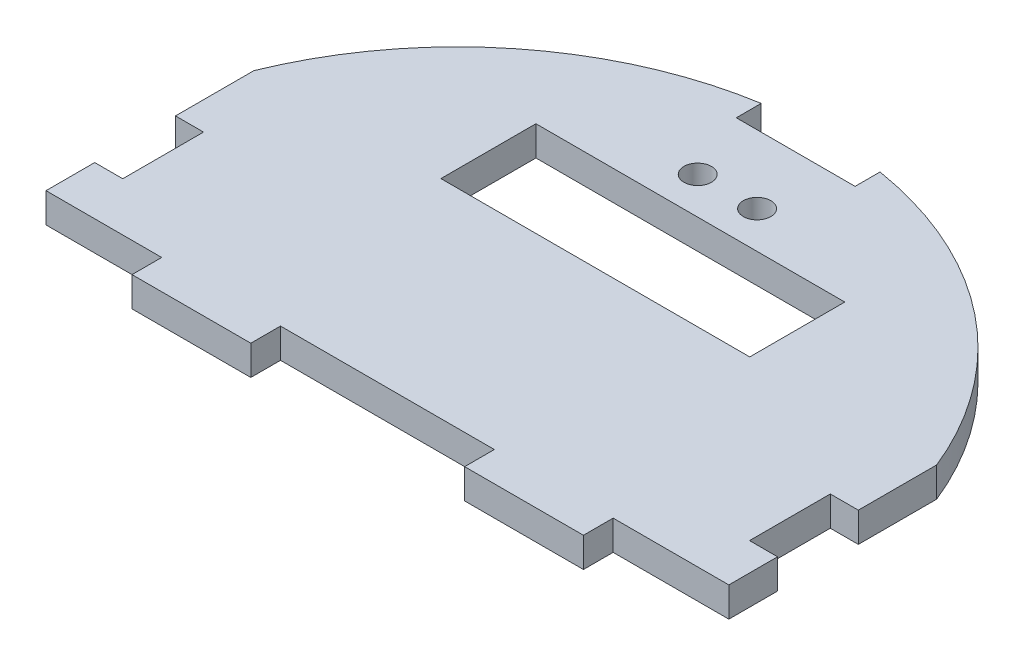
ISO-10303-21;
HEADER;
FILE_DESCRIPTION(('STEP AP214'),'2;1');
FILE_NAME('part.step','',(''),(''),'','','');
FILE_SCHEMA(('AUTOMOTIVE_DESIGN { 1 0 10303 214 1 1 1 1 }'));
ENDSEC;
DATA;
#1=APPLICATION_CONTEXT('core data for automotive mechanical design processes');
#2=APPLICATION_PROTOCOL_DEFINITION('international standard','automotive_design',2000,#1);
#3=PRODUCT_CONTEXT('',#1,'mechanical');
#4=PRODUCT('Part','Part','',(#3));
#5=PRODUCT_RELATED_PRODUCT_CATEGORY('part','',(#4));
#6=PRODUCT_DEFINITION_FORMATION('','',#4);
#7=PRODUCT_DEFINITION_CONTEXT('part definition',#1,'design');
#8=PRODUCT_DEFINITION('design','',#6,#7);
#9=PRODUCT_DEFINITION_SHAPE('','',#8);
#10=(LENGTH_UNIT() NAMED_UNIT(*) SI_UNIT(.MILLI.,.METRE.));
#11=(NAMED_UNIT(*) PLANE_ANGLE_UNIT() SI_UNIT($,.RADIAN.));
#12=(NAMED_UNIT(*) SI_UNIT($,.STERADIAN.) SOLID_ANGLE_UNIT());
#13=UNCERTAINTY_MEASURE_WITH_UNIT(LENGTH_MEASURE(1.E-05),#10,'distance_accuracy_value','');
#14=(GEOMETRIC_REPRESENTATION_CONTEXT(3) GLOBAL_UNCERTAINTY_ASSIGNED_CONTEXT((#13)) GLOBAL_UNIT_ASSIGNED_CONTEXT((#10,
#11,#12)) REPRESENTATION_CONTEXT('',''));
#15=CARTESIAN_POINT('',(0.,0.,0.));
#16=DIRECTION('',(0.,0.,1.));
#17=DIRECTION('',(1.,0.,0.));
#18=AXIS2_PLACEMENT_3D('',#15,#16,#17);
#19=CARTESIAN_POINT('',(-75.3970171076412,3.175,-20.56));
#20=DIRECTION('',(0.,0.,-1.));
#21=DIRECTION('',(-1.,0.,0.));
#22=AXIS2_PLACEMENT_3D('',#19,#20,#21);
#23=PLANE('',#22);
#24=DIRECTION('',(1.,0.,0.));
#25=VECTOR('',#24,1.);
#26=CARTESIAN_POINT('',(-75.3970171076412,0.,-20.56));
#27=LINE('',#26,#25);
#28=CARTESIAN_POINT('',(-16.51,0.,-20.56));
#29=VERTEX_POINT('',#28);
#30=CARTESIAN_POINT('',(16.51,0.,-20.56));
#31=VERTEX_POINT('',#30);
#32=EDGE_CURVE('E323',#29,#31,#27,.T.);
#33=ORIENTED_EDGE('',*,*,#32,.T.);
#34=DIRECTION('',(0.,-1.,0.));
#35=VECTOR('',#34,1.);
#36=CARTESIAN_POINT('',(16.51,3.175,-20.56));
#37=LINE('',#36,#35);
#38=CARTESIAN_POINT('',(16.51,3.175,-20.56));
#39=VERTEX_POINT('',#38);
#40=EDGE_CURVE('E11',#39,#31,#37,.T.);
#41=ORIENTED_EDGE('',*,*,#40,.F.);
#42=DIRECTION('',(1.,0.,0.));
#43=VECTOR('',#42,1.);
#44=CARTESIAN_POINT('',(-75.3970171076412,3.175,-20.56));
#45=LINE('',#44,#43);
#46=CARTESIAN_POINT('',(-16.51,3.175,-20.56));
#47=VERTEX_POINT('',#46);
#48=EDGE_CURVE('E233',#47,#39,#45,.T.);
#49=ORIENTED_EDGE('',*,*,#48,.F.);
#50=DIRECTION('',(0.,-1.,0.));
#51=VECTOR('',#50,1.);
#52=CARTESIAN_POINT('',(-16.51,3.175,-20.56));
#53=LINE('',#52,#51);
#54=EDGE_CURVE('E52',#47,#29,#53,.T.);
#55=ORIENTED_EDGE('',*,*,#54,.T.);
#56=EDGE_LOOP('',(#33,#41,#49,#55));
#57=FACE_BOUND('',#56,.T.);
#58=ADVANCED_FACE('F33',(#57),#23,.F.);
#59=CARTESIAN_POINT('',(16.51,3.175,-9.97536585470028));
#60=DIRECTION('',(1.,0.,0.));
#61=DIRECTION('',(0.,0.,-1.));
#62=AXIS2_PLACEMENT_3D('',#59,#60,#61);
#63=PLANE('',#62);
#64=DIRECTION('',(0.,0.,1.));
#65=VECTOR('',#64,1.);
#66=CARTESIAN_POINT('',(16.51,0.,-9.97536585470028));
#67=LINE('',#66,#65);
#68=CARTESIAN_POINT('',(16.51,0.,-10.4));
#69=VERTEX_POINT('',#68);
#70=EDGE_CURVE('E239',#31,#69,#67,.T.);
#71=ORIENTED_EDGE('',*,*,#70,.T.);
#72=DIRECTION('',(0.,-1.,0.));
#73=VECTOR('',#72,1.);
#74=CARTESIAN_POINT('',(16.51,3.175,-10.4));
#75=LINE('',#74,#73);
#76=CARTESIAN_POINT('',(16.51,3.175,-10.4));
#77=VERTEX_POINT('',#76);
#78=EDGE_CURVE('E43',#77,#69,#75,.T.);
#79=ORIENTED_EDGE('',*,*,#78,.F.);
#80=DIRECTION('',(0.,0.,1.));
#81=VECTOR('',#80,1.);
#82=CARTESIAN_POINT('',(16.51,3.175,-9.97536585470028));
#83=LINE('',#82,#81);
#84=EDGE_CURVE('E226',#39,#77,#83,.T.);
#85=ORIENTED_EDGE('',*,*,#84,.F.);
#86=ORIENTED_EDGE('',*,*,#40,.T.);
#87=EDGE_LOOP('',(#71,#79,#85,#86));
#88=FACE_BOUND('',#87,.T.);
#89=ADVANCED_FACE('F238',(#88),#63,.F.);
#90=CARTESIAN_POINT('',(-75.3970171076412,3.175,-10.4));
#91=DIRECTION('',(0.,0.,-1.));
#92=DIRECTION('',(-1.,0.,0.));
#93=AXIS2_PLACEMENT_3D('',#90,#91,#92);
#94=PLANE('',#93);
#95=DIRECTION('',(1.,0.,0.));
#96=VECTOR('',#95,1.);
#97=CARTESIAN_POINT('',(-75.3970171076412,0.,-10.4));
#98=LINE('',#97,#96);
#99=CARTESIAN_POINT('',(-16.51,0.,-10.4));
#100=VERTEX_POINT('',#99);
#101=EDGE_CURVE('E326',#100,#69,#98,.T.);
#102=ORIENTED_EDGE('',*,*,#101,.F.);
#103=DIRECTION('',(0.,-1.,0.));
#104=VECTOR('',#103,1.);
#105=CARTESIAN_POINT('',(-16.51,3.175,-10.4));
#106=LINE('',#105,#104);
#107=CARTESIAN_POINT('',(-16.51,3.175,-10.4));
#108=VERTEX_POINT('',#107);
#109=EDGE_CURVE('E138',#108,#100,#106,.T.);
#110=ORIENTED_EDGE('',*,*,#109,.F.);
#111=DIRECTION('',(1.,0.,0.));
#112=VECTOR('',#111,1.);
#113=CARTESIAN_POINT('',(-75.3970171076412,3.175,-10.4));
#114=LINE('',#113,#112);
#115=EDGE_CURVE('E232',#108,#77,#114,.T.);
#116=ORIENTED_EDGE('',*,*,#115,.T.);
#117=ORIENTED_EDGE('',*,*,#78,.T.);
#118=EDGE_LOOP('',(#102,#110,#116,#117));
#119=FACE_BOUND('',#118,.T.);
#120=ADVANCED_FACE('F243',(#119),#94,.T.);
#121=CARTESIAN_POINT('',(0.,3.175,4.37825203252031));
#122=DIRECTION('',(0.,-1.,0.));
#123=DIRECTION('',(0.,0.,-1.));
#124=AXIS2_PLACEMENT_3D('',#121,#122,#123);
#125=CYLINDRICAL_SURFACE('',#124,39.3782520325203);
#126=CARTESIAN_POINT('',(0.,0.,4.37825203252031));
#127=DIRECTION('',(0.,1.,0.));
#128=DIRECTION('',(0.,0.,1.));
#129=AXIS2_PLACEMENT_3D('',#126,#127,#128);
#130=CIRCLE('',#129,39.3782520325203);
#131=CARTESIAN_POINT('',(-36.5,0.,-10.4));
#132=VERTEX_POINT('',#131);
#133=CARTESIAN_POINT('',(-6.35000000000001,0.,-34.4846381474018));
#134=VERTEX_POINT('',#133);
#135=EDGE_CURVE('E256',#132,#134,#130,.F.);
#136=ORIENTED_EDGE('',*,*,#135,.F.);
#137=DIRECTION('',(0.,-1.,0.));
#138=VECTOR('',#137,1.);
#139=CARTESIAN_POINT('',(-36.5,3.175,-10.4));
#140=LINE('',#139,#138);
#141=CARTESIAN_POINT('',(-36.5,3.175,-10.4));
#142=VERTEX_POINT('',#141);
#143=EDGE_CURVE('E37',#142,#132,#140,.T.);
#144=ORIENTED_EDGE('',*,*,#143,.F.);
#145=CARTESIAN_POINT('',(0.,3.175,4.37825203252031));
#146=DIRECTION('',(0.,1.,0.));
#147=DIRECTION('',(0.,0.,1.));
#148=AXIS2_PLACEMENT_3D('',#145,#146,#147);
#149=CIRCLE('',#148,39.3782520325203);
#150=CARTESIAN_POINT('',(-6.35000000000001,3.175,-34.4846381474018));
#151=VERTEX_POINT('',#150);
#152=EDGE_CURVE('E337',#142,#151,#149,.F.);
#153=ORIENTED_EDGE('',*,*,#152,.T.);
#154=DIRECTION('',(0.,-1.,0.));
#155=VECTOR('',#154,1.);
#156=CARTESIAN_POINT('',(-6.35000000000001,3.175,-34.4846381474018));
#157=LINE('',#156,#155);
#158=EDGE_CURVE('E255',#151,#134,#157,.T.);
#159=ORIENTED_EDGE('',*,*,#158,.T.);
#160=EDGE_LOOP('',(#136,#144,#153,#159));
#161=FACE_BOUND('',#160,.T.);
#162=ADVANCED_FACE('F35',(#161),#125,.T.);
#163=CARTESIAN_POINT('',(-36.5,3.175,-9.97536585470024));
#164=DIRECTION('',(-1.,0.,0.));
#165=DIRECTION('',(0.,0.,1.));
#166=AXIS2_PLACEMENT_3D('',#163,#164,#165);
#167=PLANE('',#166);
#168=DIRECTION('',(0.,0.,-1.));
#169=VECTOR('',#168,1.);
#170=CARTESIAN_POINT('',(-36.5,0.,-9.97536585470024));
#171=LINE('',#170,#169);
#172=CARTESIAN_POINT('',(-36.5,0.,-2.018));
#173=VERTEX_POINT('',#172);
#174=EDGE_CURVE('E259',#173,#132,#171,.T.);
#175=ORIENTED_EDGE('',*,*,#174,.F.);
#176=DIRECTION('',(0.,-1.,0.));
#177=VECTOR('',#176,1.);
#178=CARTESIAN_POINT('',(-36.5,3.175,-2.018));
#179=LINE('',#178,#177);
#180=CARTESIAN_POINT('',(-36.5,3.175,-2.018));
#181=VERTEX_POINT('',#180);
#182=EDGE_CURVE('E387',#181,#173,#179,.T.);
#183=ORIENTED_EDGE('',*,*,#182,.F.);
#184=DIRECTION('',(0.,0.,-1.));
#185=VECTOR('',#184,1.);
#186=CARTESIAN_POINT('',(-36.5,3.175,-9.97536585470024));
#187=LINE('',#186,#185);
#188=EDGE_CURVE('E396',#181,#142,#187,.T.);
#189=ORIENTED_EDGE('',*,*,#188,.T.);
#190=ORIENTED_EDGE('',*,*,#143,.T.);
#191=EDGE_LOOP('',(#175,#183,#189,#190));
#192=FACE_BOUND('',#191,.T.);
#193=ADVANCED_FACE('F394',(#192),#167,.T.);
#194=CARTESIAN_POINT('',(-75.3970171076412,3.175,-2.01800000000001));
#195=DIRECTION('',(0.,0.,-1.));
#196=DIRECTION('',(-1.,0.,0.));
#197=AXIS2_PLACEMENT_3D('',#194,#195,#196);
#198=PLANE('',#197);
#199=DIRECTION('',(1.,0.,0.));
#200=VECTOR('',#199,1.);
#201=CARTESIAN_POINT('',(-75.3970171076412,0.,-2.01800000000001));
#202=LINE('',#201,#200);
#203=CARTESIAN_POINT('',(-33.5028,0.,-2.018));
#204=VERTEX_POINT('',#203);
#205=EDGE_CURVE('E262',#173,#204,#202,.T.);
#206=ORIENTED_EDGE('',*,*,#205,.T.);
#207=DIRECTION('',(0.,-1.,0.));
#208=VECTOR('',#207,1.);
#209=CARTESIAN_POINT('',(-33.5028,3.175,-2.018));
#210=LINE('',#209,#208);
#211=CARTESIAN_POINT('',(-33.5028,3.175,-2.018));
#212=VERTEX_POINT('',#211);
#213=EDGE_CURVE('E386',#212,#204,#210,.T.);
#214=ORIENTED_EDGE('',*,*,#213,.F.);
#215=DIRECTION('',(1.,0.,0.));
#216=VECTOR('',#215,1.);
#217=CARTESIAN_POINT('',(-75.3970171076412,3.175,-2.01800000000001));
#218=LINE('',#217,#216);
#219=EDGE_CURVE('E405',#181,#212,#218,.T.);
#220=ORIENTED_EDGE('',*,*,#219,.F.);
#221=ORIENTED_EDGE('',*,*,#182,.T.);
#222=EDGE_LOOP('',(#206,#214,#220,#221));
#223=FACE_BOUND('',#222,.T.);
#224=ADVANCED_FACE('F403',(#223),#198,.F.);
#225=CARTESIAN_POINT('',(-33.5028,3.175,-9.97536585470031));
#226=DIRECTION('',(-1.,0.,0.));
#227=DIRECTION('',(0.,0.,1.));
#228=AXIS2_PLACEMENT_3D('',#225,#226,#227);
#229=PLANE('',#228);
#230=DIRECTION('',(0.,0.,-1.));
#231=VECTOR('',#230,1.);
#232=CARTESIAN_POINT('',(-33.5028,0.,-9.97536585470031));
#233=LINE('',#232,#231);
#234=CARTESIAN_POINT('',(-33.5028,0.,6.61799999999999));
#235=VERTEX_POINT('',#234);
#236=EDGE_CURVE('E265',#235,#204,#233,.T.);
#237=ORIENTED_EDGE('',*,*,#236,.F.);
#238=DIRECTION('',(0.,-1.,0.));
#239=VECTOR('',#238,1.);
#240=CARTESIAN_POINT('',(-33.5028,3.175,6.61799999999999));
#241=LINE('',#240,#239);
#242=CARTESIAN_POINT('',(-33.5028,3.175,6.61799999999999));
#243=VERTEX_POINT('',#242);
#244=EDGE_CURVE('E384',#243,#235,#241,.T.);
#245=ORIENTED_EDGE('',*,*,#244,.F.);
#246=DIRECTION('',(0.,0.,-1.));
#247=VECTOR('',#246,1.);
#248=CARTESIAN_POINT('',(-33.5028,3.175,-9.97536585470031));
#249=LINE('',#248,#247);
#250=EDGE_CURVE('E408',#243,#212,#249,.T.);
#251=ORIENTED_EDGE('',*,*,#250,.T.);
#252=ORIENTED_EDGE('',*,*,#213,.T.);
#253=EDGE_LOOP('',(#237,#245,#251,#252));
#254=FACE_BOUND('',#253,.T.);
#255=ADVANCED_FACE('F409',(#254),#229,.T.);
#256=CARTESIAN_POINT('',(-75.3970171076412,3.175,6.61799999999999));
#257=DIRECTION('',(0.,0.,-1.));
#258=DIRECTION('',(-1.,0.,0.));
#259=AXIS2_PLACEMENT_3D('',#256,#257,#258);
#260=PLANE('',#259);
#261=DIRECTION('',(1.,0.,0.));
#262=VECTOR('',#261,1.);
#263=CARTESIAN_POINT('',(-75.3970171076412,0.,6.61799999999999));
#264=LINE('',#263,#262);
#265=CARTESIAN_POINT('',(-36.5,0.,6.618));
#266=VERTEX_POINT('',#265);
#267=EDGE_CURVE('E268',#266,#235,#264,.T.);
#268=ORIENTED_EDGE('',*,*,#267,.F.);
#269=DIRECTION('',(0.,-1.,0.));
#270=VECTOR('',#269,1.);
#271=CARTESIAN_POINT('',(-36.5,3.175,6.618));
#272=LINE('',#271,#270);
#273=CARTESIAN_POINT('',(-36.5,3.175,6.618));
#274=VERTEX_POINT('',#273);
#275=EDGE_CURVE('E382',#274,#266,#272,.T.);
#276=ORIENTED_EDGE('',*,*,#275,.F.);
#277=DIRECTION('',(1.,0.,0.));
#278=VECTOR('',#277,1.);
#279=CARTESIAN_POINT('',(-75.3970171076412,3.175,6.61799999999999));
#280=LINE('',#279,#278);
#281=EDGE_CURVE('E413',#274,#243,#280,.T.);
#282=ORIENTED_EDGE('',*,*,#281,.T.);
#283=ORIENTED_EDGE('',*,*,#244,.T.);
#284=EDGE_LOOP('',(#268,#276,#282,#283));
#285=FACE_BOUND('',#284,.T.);
#286=ADVANCED_FACE('F548',(#285),#260,.T.);
#287=CARTESIAN_POINT('',(-36.5,3.175,-9.97536585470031));
#288=DIRECTION('',(1.,0.,0.));
#289=DIRECTION('',(0.,0.,-1.));
#290=AXIS2_PLACEMENT_3D('',#287,#288,#289);
#291=PLANE('',#290);
#292=DIRECTION('',(0.,0.,1.));
#293=VECTOR('',#292,1.);
#294=CARTESIAN_POINT('',(-36.5,0.,-9.97536585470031));
#295=LINE('',#294,#293);
#296=CARTESIAN_POINT('',(-36.5,0.,11.825));
#297=VERTEX_POINT('',#296);
#298=EDGE_CURVE('E271',#266,#297,#295,.T.);
#299=ORIENTED_EDGE('',*,*,#298,.T.);
#300=DIRECTION('',(0.,-1.,0.));
#301=VECTOR('',#300,1.);
#302=CARTESIAN_POINT('',(-36.5,3.175,11.825));
#303=LINE('',#302,#301);
#304=CARTESIAN_POINT('',(-36.5,3.175,11.825));
#305=VERTEX_POINT('',#304);
#306=EDGE_CURVE('E380',#305,#297,#303,.T.);
#307=ORIENTED_EDGE('',*,*,#306,.F.);
#308=DIRECTION('',(0.,0.,1.));
#309=VECTOR('',#308,1.);
#310=CARTESIAN_POINT('',(-36.5,3.175,-9.97536585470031));
#311=LINE('',#310,#309);
#312=EDGE_CURVE('E415',#274,#305,#311,.T.);
#313=ORIENTED_EDGE('',*,*,#312,.F.);
#314=ORIENTED_EDGE('',*,*,#275,.T.);
#315=EDGE_LOOP('',(#299,#307,#313,#314));
#316=FACE_BOUND('',#315,.T.);
#317=ADVANCED_FACE('F550',(#316),#291,.F.);
#318=CARTESIAN_POINT('',(-75.3970171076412,3.175,11.825));
#319=DIRECTION('',(0.,0.,1.));
#320=DIRECTION('',(1.,0.,0.));
#321=AXIS2_PLACEMENT_3D('',#318,#319,#320);
#322=PLANE('',#321);
#323=DIRECTION('',(-1.,0.,0.));
#324=VECTOR('',#323,1.);
#325=CARTESIAN_POINT('',(-75.3970171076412,0.,11.825));
#326=LINE('',#325,#324);
#327=CARTESIAN_POINT('',(-24.13,0.,11.825));
#328=VERTEX_POINT('',#327);
#329=EDGE_CURVE('E274',#328,#297,#326,.T.);
#330=ORIENTED_EDGE('',*,*,#329,.F.);
#331=DIRECTION('',(0.,-1.,0.));
#332=VECTOR('',#331,1.);
#333=CARTESIAN_POINT('',(-24.13,3.175,11.825));
#334=LINE('',#333,#332);
#335=CARTESIAN_POINT('',(-24.13,3.175,11.825));
#336=VERTEX_POINT('',#335);
#337=EDGE_CURVE('E378',#336,#328,#334,.T.);
#338=ORIENTED_EDGE('',*,*,#337,.F.);
#339=DIRECTION('',(-1.,0.,0.));
#340=VECTOR('',#339,1.);
#341=CARTESIAN_POINT('',(-75.3970171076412,3.175,11.825));
#342=LINE('',#341,#340);
#343=EDGE_CURVE('E421',#336,#305,#342,.T.);
#344=ORIENTED_EDGE('',*,*,#343,.T.);
#345=ORIENTED_EDGE('',*,*,#306,.T.);
#346=EDGE_LOOP('',(#330,#338,#344,#345));
#347=FACE_BOUND('',#346,.T.);
#348=ADVANCED_FACE('F542',(#347),#322,.T.);
#349=CARTESIAN_POINT('',(-24.13,3.175,-9.97536585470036));
#350=DIRECTION('',(-1.,0.,0.));
#351=DIRECTION('',(0.,0.,1.));
#352=AXIS2_PLACEMENT_3D('',#349,#350,#351);
#353=PLANE('',#352);
#354=DIRECTION('',(0.,0.,-1.));
#355=VECTOR('',#354,1.);
#356=CARTESIAN_POINT('',(-24.13,0.,-9.97536585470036));
#357=LINE('',#356,#355);
#358=CARTESIAN_POINT('',(-24.13,0.,15.));
#359=VERTEX_POINT('',#358);
#360=EDGE_CURVE('E277',#359,#328,#357,.T.);
#361=ORIENTED_EDGE('',*,*,#360,.F.);
#362=DIRECTION('',(0.,-1.,0.));
#363=VECTOR('',#362,1.);
#364=CARTESIAN_POINT('',(-24.13,3.175,15.));
#365=LINE('',#364,#363);
#366=CARTESIAN_POINT('',(-24.13,3.175,15.));
#367=VERTEX_POINT('',#366);
#368=EDGE_CURVE('E376',#367,#359,#365,.T.);
#369=ORIENTED_EDGE('',*,*,#368,.F.);
#370=DIRECTION('',(0.,0.,-1.));
#371=VECTOR('',#370,1.);
#372=CARTESIAN_POINT('',(-24.13,3.175,-9.97536585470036));
#373=LINE('',#372,#371);
#374=EDGE_CURVE('E424',#367,#336,#373,.T.);
#375=ORIENTED_EDGE('',*,*,#374,.T.);
#376=ORIENTED_EDGE('',*,*,#337,.T.);
#377=EDGE_LOOP('',(#361,#369,#375,#376));
#378=FACE_BOUND('',#377,.T.);
#379=ADVANCED_FACE('F537',(#378),#353,.T.);
#380=CARTESIAN_POINT('',(-75.3970171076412,3.175,15.));
#381=DIRECTION('',(0.,0.,-1.));
#382=DIRECTION('',(-1.,0.,0.));
#383=AXIS2_PLACEMENT_3D('',#380,#381,#382);
#384=PLANE('',#383);
#385=DIRECTION('',(1.,0.,0.));
#386=VECTOR('',#385,1.);
#387=CARTESIAN_POINT('',(-75.3970171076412,0.,15.));
#388=LINE('',#387,#386);
#389=CARTESIAN_POINT('',(-11.43,0.,15.));
#390=VERTEX_POINT('',#389);
#391=EDGE_CURVE('E280',#359,#390,#388,.T.);
#392=ORIENTED_EDGE('',*,*,#391,.T.);
#393=DIRECTION('',(0.,-1.,0.));
#394=VECTOR('',#393,1.);
#395=CARTESIAN_POINT('',(-11.43,3.175,15.));
#396=LINE('',#395,#394);
#397=CARTESIAN_POINT('',(-11.43,3.175,15.));
#398=VERTEX_POINT('',#397);
#399=EDGE_CURVE('E374',#398,#390,#396,.T.);
#400=ORIENTED_EDGE('',*,*,#399,.F.);
#401=DIRECTION('',(1.,0.,0.));
#402=VECTOR('',#401,1.);
#403=CARTESIAN_POINT('',(-75.3970171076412,3.175,15.));
#404=LINE('',#403,#402);
#405=EDGE_CURVE('E427',#367,#398,#404,.T.);
#406=ORIENTED_EDGE('',*,*,#405,.F.);
#407=ORIENTED_EDGE('',*,*,#368,.T.);
#408=EDGE_LOOP('',(#392,#400,#406,#407));
#409=FACE_BOUND('',#408,.T.);
#410=ADVANCED_FACE('F534',(#409),#384,.F.);
#411=CARTESIAN_POINT('',(-11.43,3.175,-9.97536585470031));
#412=DIRECTION('',(1.,0.,0.));
#413=DIRECTION('',(0.,0.,-1.));
#414=AXIS2_PLACEMENT_3D('',#411,#412,#413);
#415=PLANE('',#414);
#416=DIRECTION('',(0.,0.,1.));
#417=VECTOR('',#416,1.);
#418=CARTESIAN_POINT('',(-11.43,0.,-9.97536585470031));
#419=LINE('',#418,#417);
#420=CARTESIAN_POINT('',(-11.43,0.,11.825));
#421=VERTEX_POINT('',#420);
#422=EDGE_CURVE('E283',#421,#390,#419,.T.);
#423=ORIENTED_EDGE('',*,*,#422,.F.);
#424=DIRECTION('',(0.,-1.,0.));
#425=VECTOR('',#424,1.);
#426=CARTESIAN_POINT('',(-11.43,3.175,11.825));
#427=LINE('',#426,#425);
#428=CARTESIAN_POINT('',(-11.43,3.175,11.825));
#429=VERTEX_POINT('',#428);
#430=EDGE_CURVE('E372',#429,#421,#427,.T.);
#431=ORIENTED_EDGE('',*,*,#430,.F.);
#432=DIRECTION('',(0.,0.,1.));
#433=VECTOR('',#432,1.);
#434=CARTESIAN_POINT('',(-11.43,3.175,-9.97536585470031));
#435=LINE('',#434,#433);
#436=EDGE_CURVE('E429',#429,#398,#435,.T.);
#437=ORIENTED_EDGE('',*,*,#436,.T.);
#438=ORIENTED_EDGE('',*,*,#399,.T.);
#439=EDGE_LOOP('',(#423,#431,#437,#438));
#440=FACE_BOUND('',#439,.T.);
#441=ADVANCED_FACE('F528',(#440),#415,.T.);
#442=CARTESIAN_POINT('',(-75.3970171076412,3.175,11.825));
#443=DIRECTION('',(0.,0.,-1.));
#444=DIRECTION('',(-1.,0.,0.));
#445=AXIS2_PLACEMENT_3D('',#442,#443,#444);
#446=PLANE('',#445);
#447=DIRECTION('',(1.,0.,0.));
#448=VECTOR('',#447,1.);
#449=CARTESIAN_POINT('',(-75.3970171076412,0.,11.825));
#450=LINE('',#449,#448);
#451=CARTESIAN_POINT('',(11.43,0.,11.825));
#452=VERTEX_POINT('',#451);
#453=EDGE_CURVE('E286',#421,#452,#450,.T.);
#454=ORIENTED_EDGE('',*,*,#453,.T.);
#455=DIRECTION('',(0.,-1.,0.));
#456=VECTOR('',#455,1.);
#457=CARTESIAN_POINT('',(11.43,3.175,11.825));
#458=LINE('',#457,#456);
#459=CARTESIAN_POINT('',(11.43,3.175,11.825));
#460=VERTEX_POINT('',#459);
#461=EDGE_CURVE('E369',#460,#452,#458,.T.);
#462=ORIENTED_EDGE('',*,*,#461,.F.);
#463=DIRECTION('',(1.,0.,0.));
#464=VECTOR('',#463,1.);
#465=CARTESIAN_POINT('',(-75.3970171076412,3.175,11.825));
#466=LINE('',#465,#464);
#467=EDGE_CURVE('E432',#429,#460,#466,.T.);
#468=ORIENTED_EDGE('',*,*,#467,.F.);
#469=ORIENTED_EDGE('',*,*,#430,.T.);
#470=EDGE_LOOP('',(#454,#462,#468,#469));
#471=FACE_BOUND('',#470,.T.);
#472=ADVANCED_FACE('F597',(#471),#446,.F.);
#473=CARTESIAN_POINT('',(11.43,3.175,-9.97536585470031));
#474=DIRECTION('',(1.,0.,0.));
#475=DIRECTION('',(0.,0.,-1.));
#476=AXIS2_PLACEMENT_3D('',#473,#474,#475);
#477=PLANE('',#476);
#478=DIRECTION('',(0.,0.,1.));
#479=VECTOR('',#478,1.);
#480=CARTESIAN_POINT('',(11.43,0.,-9.97536585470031));
#481=LINE('',#480,#479);
#482=CARTESIAN_POINT('',(11.43,0.,15.));
#483=VERTEX_POINT('',#482);
#484=EDGE_CURVE('E288',#452,#483,#481,.T.);
#485=ORIENTED_EDGE('',*,*,#484,.T.);
#486=DIRECTION('',(0.,-1.,0.));
#487=VECTOR('',#486,1.);
#488=CARTESIAN_POINT('',(11.43,3.175,15.));
#489=LINE('',#488,#487);
#490=CARTESIAN_POINT('',(11.43,3.175,15.));
#491=VERTEX_POINT('',#490);
#492=EDGE_CURVE('E366',#491,#483,#489,.T.);
#493=ORIENTED_EDGE('',*,*,#492,.F.);
#494=DIRECTION('',(0.,0.,1.));
#495=VECTOR('',#494,1.);
#496=CARTESIAN_POINT('',(11.43,3.175,-9.97536585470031));
#497=LINE('',#496,#495);
#498=EDGE_CURVE('E434',#460,#491,#497,.T.);
#499=ORIENTED_EDGE('',*,*,#498,.F.);
#500=ORIENTED_EDGE('',*,*,#461,.T.);
#501=EDGE_LOOP('',(#485,#493,#499,#500));
#502=FACE_BOUND('',#501,.T.);
#503=ADVANCED_FACE('F521',(#502),#477,.F.);
#504=CARTESIAN_POINT('',(-75.3970171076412,3.175,15.));
#505=DIRECTION('',(0.,0.,-1.));
#506=DIRECTION('',(-1.,0.,0.));
#507=AXIS2_PLACEMENT_3D('',#504,#505,#506);
#508=PLANE('',#507);
#509=DIRECTION('',(1.,0.,0.));
#510=VECTOR('',#509,1.);
#511=CARTESIAN_POINT('',(-75.3970171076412,0.,15.));
#512=LINE('',#511,#510);
#513=CARTESIAN_POINT('',(24.13,0.,15.));
#514=VERTEX_POINT('',#513);
#515=EDGE_CURVE('E290',#483,#514,#512,.T.);
#516=ORIENTED_EDGE('',*,*,#515,.T.);
#517=DIRECTION('',(0.,-1.,0.));
#518=VECTOR('',#517,1.);
#519=CARTESIAN_POINT('',(24.13,3.175,15.));
#520=LINE('',#519,#518);
#521=CARTESIAN_POINT('',(24.13,3.175,15.));
#522=VERTEX_POINT('',#521);
#523=EDGE_CURVE('E363',#522,#514,#520,.T.);
#524=ORIENTED_EDGE('',*,*,#523,.F.);
#525=DIRECTION('',(1.,0.,0.));
#526=VECTOR('',#525,1.);
#527=CARTESIAN_POINT('',(-75.3970171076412,3.175,15.));
#528=LINE('',#527,#526);
#529=EDGE_CURVE('E436',#491,#522,#528,.T.);
#530=ORIENTED_EDGE('',*,*,#529,.F.);
#531=ORIENTED_EDGE('',*,*,#492,.T.);
#532=EDGE_LOOP('',(#516,#524,#530,#531));
#533=FACE_BOUND('',#532,.T.);
#534=ADVANCED_FACE('F517',(#533),#508,.F.);
#535=CARTESIAN_POINT('',(24.13,3.175,-9.9753658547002));
#536=DIRECTION('',(-1.,0.,0.));
#537=DIRECTION('',(0.,0.,1.));
#538=AXIS2_PLACEMENT_3D('',#535,#536,#537);
#539=PLANE('',#538);
#540=DIRECTION('',(0.,0.,-1.));
#541=VECTOR('',#540,1.);
#542=CARTESIAN_POINT('',(24.13,0.,-9.9753658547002));
#543=LINE('',#542,#541);
#544=CARTESIAN_POINT('',(24.13,0.,11.825));
#545=VERTEX_POINT('',#544);
#546=EDGE_CURVE('E292',#514,#545,#543,.T.);
#547=ORIENTED_EDGE('',*,*,#546,.T.);
#548=DIRECTION('',(0.,-1.,0.));
#549=VECTOR('',#548,1.);
#550=CARTESIAN_POINT('',(24.13,3.175,11.825));
#551=LINE('',#550,#549);
#552=CARTESIAN_POINT('',(24.13,3.175,11.825));
#553=VERTEX_POINT('',#552);
#554=EDGE_CURVE('E360',#553,#545,#551,.T.);
#555=ORIENTED_EDGE('',*,*,#554,.F.);
#556=DIRECTION('',(0.,0.,-1.));
#557=VECTOR('',#556,1.);
#558=CARTESIAN_POINT('',(24.13,3.175,-9.9753658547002));
#559=LINE('',#558,#557);
#560=EDGE_CURVE('E438',#522,#553,#559,.T.);
#561=ORIENTED_EDGE('',*,*,#560,.F.);
#562=ORIENTED_EDGE('',*,*,#523,.T.);
#563=EDGE_LOOP('',(#547,#555,#561,#562));
#564=FACE_BOUND('',#563,.T.);
#565=ADVANCED_FACE('F512',(#564),#539,.F.);
#566=CARTESIAN_POINT('',(-75.3970171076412,3.175,11.825));
#567=DIRECTION('',(0.,0.,-1.));
#568=DIRECTION('',(-1.,0.,0.));
#569=AXIS2_PLACEMENT_3D('',#566,#567,#568);
#570=PLANE('',#569);
#571=DIRECTION('',(1.,0.,0.));
#572=VECTOR('',#571,1.);
#573=CARTESIAN_POINT('',(-75.3970171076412,0.,11.825));
#574=LINE('',#573,#572);
#575=CARTESIAN_POINT('',(36.5,0.,11.825));
#576=VERTEX_POINT('',#575);
#577=EDGE_CURVE('E294',#545,#576,#574,.T.);
#578=ORIENTED_EDGE('',*,*,#577,.T.);
#579=DIRECTION('',(0.,-1.,0.));
#580=VECTOR('',#579,1.);
#581=CARTESIAN_POINT('',(36.5,3.175,11.825));
#582=LINE('',#581,#580);
#583=CARTESIAN_POINT('',(36.5,3.175,11.825));
#584=VERTEX_POINT('',#583);
#585=EDGE_CURVE('E358',#584,#576,#582,.T.);
#586=ORIENTED_EDGE('',*,*,#585,.F.);
#587=DIRECTION('',(1.,0.,0.));
#588=VECTOR('',#587,1.);
#589=CARTESIAN_POINT('',(-75.3970171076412,3.175,11.825));
#590=LINE('',#589,#588);
#591=EDGE_CURVE('E440',#553,#584,#590,.T.);
#592=ORIENTED_EDGE('',*,*,#591,.F.);
#593=ORIENTED_EDGE('',*,*,#554,.T.);
#594=EDGE_LOOP('',(#578,#586,#592,#593));
#595=FACE_BOUND('',#594,.T.);
#596=ADVANCED_FACE('F506',(#595),#570,.F.);
#597=CARTESIAN_POINT('',(36.5,3.175,-9.97536585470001));
#598=DIRECTION('',(1.,0.,0.));
#599=DIRECTION('',(0.,0.,-1.));
#600=AXIS2_PLACEMENT_3D('',#597,#598,#599);
#601=PLANE('',#600);
#602=DIRECTION('',(0.,0.,1.));
#603=VECTOR('',#602,1.);
#604=CARTESIAN_POINT('',(36.5,0.,-9.97536585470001));
#605=LINE('',#604,#603);
#606=CARTESIAN_POINT('',(36.5,0.,6.61799999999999));
#607=VERTEX_POINT('',#606);
#608=EDGE_CURVE('E297',#607,#576,#605,.T.);
#609=ORIENTED_EDGE('',*,*,#608,.F.);
#610=DIRECTION('',(0.,-1.,0.));
#611=VECTOR('',#610,1.);
#612=CARTESIAN_POINT('',(36.5,3.175,6.61799999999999));
#613=LINE('',#612,#611);
#614=CARTESIAN_POINT('',(36.5,3.175,6.61799999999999));
#615=VERTEX_POINT('',#614);
#616=EDGE_CURVE('E356',#615,#607,#613,.T.);
#617=ORIENTED_EDGE('',*,*,#616,.F.);
#618=DIRECTION('',(0.,0.,1.));
#619=VECTOR('',#618,1.);
#620=CARTESIAN_POINT('',(36.5,3.175,-9.97536585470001));
#621=LINE('',#620,#619);
#622=EDGE_CURVE('E442',#615,#584,#621,.T.);
#623=ORIENTED_EDGE('',*,*,#622,.T.);
#624=ORIENTED_EDGE('',*,*,#585,.T.);
#625=EDGE_LOOP('',(#609,#617,#623,#624));
#626=FACE_BOUND('',#625,.T.);
#627=ADVANCED_FACE('F502',(#626),#601,.T.);
#628=CARTESIAN_POINT('',(-75.3970171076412,3.175,6.61799999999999));
#629=DIRECTION('',(0.,0.,1.));
#630=DIRECTION('',(1.,0.,0.));
#631=AXIS2_PLACEMENT_3D('',#628,#629,#630);
#632=PLANE('',#631);
#633=DIRECTION('',(-1.,0.,0.));
#634=VECTOR('',#633,1.);
#635=CARTESIAN_POINT('',(-75.3970171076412,0.,6.61799999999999));
#636=LINE('',#635,#634);
#637=CARTESIAN_POINT('',(33.5028,0.,6.61799999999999));
#638=VERTEX_POINT('',#637);
#639=EDGE_CURVE('E300',#607,#638,#636,.T.);
#640=ORIENTED_EDGE('',*,*,#639,.T.);
#641=DIRECTION('',(0.,-1.,0.));
#642=VECTOR('',#641,1.);
#643=CARTESIAN_POINT('',(33.5028,3.175,6.61799999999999));
#644=LINE('',#643,#642);
#645=CARTESIAN_POINT('',(33.5028,3.175,6.61799999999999));
#646=VERTEX_POINT('',#645);
#647=EDGE_CURVE('E353',#646,#638,#644,.T.);
#648=ORIENTED_EDGE('',*,*,#647,.F.);
#649=DIRECTION('',(-1.,0.,0.));
#650=VECTOR('',#649,1.);
#651=CARTESIAN_POINT('',(-75.3970171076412,3.175,6.61799999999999));
#652=LINE('',#651,#650);
#653=EDGE_CURVE('E445',#615,#646,#652,.T.);
#654=ORIENTED_EDGE('',*,*,#653,.F.);
#655=ORIENTED_EDGE('',*,*,#616,.T.);
#656=EDGE_LOOP('',(#640,#648,#654,#655));
#657=FACE_BOUND('',#656,.T.);
#658=ADVANCED_FACE('F497',(#657),#632,.F.);
#659=CARTESIAN_POINT('',(33.5028,3.175,-9.97536585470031));
#660=DIRECTION('',(-1.,0.,0.));
#661=DIRECTION('',(0.,0.,1.));
#662=AXIS2_PLACEMENT_3D('',#659,#660,#661);
#663=PLANE('',#662);
#664=DIRECTION('',(0.,0.,-1.));
#665=VECTOR('',#664,1.);
#666=CARTESIAN_POINT('',(33.5028,0.,-9.97536585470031));
#667=LINE('',#666,#665);
#668=CARTESIAN_POINT('',(33.5028,0.,-2.018));
#669=VERTEX_POINT('',#668);
#670=EDGE_CURVE('E302',#638,#669,#667,.T.);
#671=ORIENTED_EDGE('',*,*,#670,.T.);
#672=DIRECTION('',(0.,-1.,0.));
#673=VECTOR('',#672,1.);
#674=CARTESIAN_POINT('',(33.5028,3.175,-2.018));
#675=LINE('',#674,#673);
#676=CARTESIAN_POINT('',(33.5028,3.175,-2.018));
#677=VERTEX_POINT('',#676);
#678=EDGE_CURVE('E351',#677,#669,#675,.T.);
#679=ORIENTED_EDGE('',*,*,#678,.F.);
#680=DIRECTION('',(0.,0.,-1.));
#681=VECTOR('',#680,1.);
#682=CARTESIAN_POINT('',(33.5028,3.175,-9.97536585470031));
#683=LINE('',#682,#681);
#684=EDGE_CURVE('E447',#646,#677,#683,.T.);
#685=ORIENTED_EDGE('',*,*,#684,.F.);
#686=ORIENTED_EDGE('',*,*,#647,.T.);
#687=EDGE_LOOP('',(#671,#679,#685,#686));
#688=FACE_BOUND('',#687,.T.);
#689=ADVANCED_FACE('F493',(#688),#663,.F.);
#690=CARTESIAN_POINT('',(-75.3970171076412,3.175,-2.01799999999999));
#691=DIRECTION('',(0.,0.,1.));
#692=DIRECTION('',(1.,0.,0.));
#693=AXIS2_PLACEMENT_3D('',#690,#691,#692);
#694=PLANE('',#693);
#695=DIRECTION('',(-1.,0.,0.));
#696=VECTOR('',#695,1.);
#697=CARTESIAN_POINT('',(-75.3970171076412,0.,-2.01799999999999));
#698=LINE('',#697,#696);
#699=CARTESIAN_POINT('',(36.5,0.,-2.018));
#700=VERTEX_POINT('',#699);
#701=EDGE_CURVE('E305',#700,#669,#698,.T.);
#702=ORIENTED_EDGE('',*,*,#701,.F.);
#703=DIRECTION('',(0.,-1.,0.));
#704=VECTOR('',#703,1.);
#705=CARTESIAN_POINT('',(36.5,3.175,-2.018));
#706=LINE('',#705,#704);
#707=CARTESIAN_POINT('',(36.5,3.175,-2.018));
#708=VERTEX_POINT('',#707);
#709=EDGE_CURVE('E349',#708,#700,#706,.T.);
#710=ORIENTED_EDGE('',*,*,#709,.F.);
#711=DIRECTION('',(-1.,0.,0.));
#712=VECTOR('',#711,1.);
#713=CARTESIAN_POINT('',(-75.3970171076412,3.175,-2.01799999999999));
#714=LINE('',#713,#712);
#715=EDGE_CURVE('E449',#708,#677,#714,.T.);
#716=ORIENTED_EDGE('',*,*,#715,.T.);
#717=ORIENTED_EDGE('',*,*,#678,.T.);
#718=EDGE_LOOP('',(#702,#710,#716,#717));
#719=FACE_BOUND('',#718,.T.);
#720=ADVANCED_FACE('F488',(#719),#694,.T.);
#721=CARTESIAN_POINT('',(36.5,3.175,-9.97536585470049));
#722=DIRECTION('',(1.,0.,0.));
#723=DIRECTION('',(0.,0.,-1.));
#724=AXIS2_PLACEMENT_3D('',#721,#722,#723);
#725=PLANE('',#724);
#726=DIRECTION('',(0.,0.,1.));
#727=VECTOR('',#726,1.);
#728=CARTESIAN_POINT('',(36.5,0.,-9.97536585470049));
#729=LINE('',#728,#727);
#730=CARTESIAN_POINT('',(36.5,0.,-10.4));
#731=VERTEX_POINT('',#730);
#732=EDGE_CURVE('E308',#731,#700,#729,.T.);
#733=ORIENTED_EDGE('',*,*,#732,.F.);
#734=DIRECTION('',(0.,-1.,0.));
#735=VECTOR('',#734,1.);
#736=CARTESIAN_POINT('',(36.5,3.175,-10.4));
#737=LINE('',#736,#735);
#738=CARTESIAN_POINT('',(36.5,3.175,-10.4));
#739=VERTEX_POINT('',#738);
#740=EDGE_CURVE('E347',#739,#731,#737,.T.);
#741=ORIENTED_EDGE('',*,*,#740,.F.);
#742=DIRECTION('',(0.,0.,1.));
#743=VECTOR('',#742,1.);
#744=CARTESIAN_POINT('',(36.5,3.175,-9.97536585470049));
#745=LINE('',#744,#743);
#746=EDGE_CURVE('E452',#739,#708,#745,.T.);
#747=ORIENTED_EDGE('',*,*,#746,.T.);
#748=ORIENTED_EDGE('',*,*,#709,.T.);
#749=EDGE_LOOP('',(#733,#741,#747,#748));
#750=FACE_BOUND('',#749,.T.);
#751=ADVANCED_FACE('F483',(#750),#725,.T.);
#752=CARTESIAN_POINT('',(0.,3.175,4.37825203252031));
#753=DIRECTION('',(0.,-1.,0.));
#754=DIRECTION('',(0.,0.,-1.));
#755=AXIS2_PLACEMENT_3D('',#752,#753,#754);
#756=CYLINDRICAL_SURFACE('',#755,39.3782520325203);
#757=CARTESIAN_POINT('',(0.,0.,4.37825203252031));
#758=DIRECTION('',(0.,1.,0.));
#759=DIRECTION('',(0.,0.,1.));
#760=AXIS2_PLACEMENT_3D('',#757,#758,#759);
#761=CIRCLE('',#760,39.3782520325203);
#762=CARTESIAN_POINT('',(6.34999999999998,0.,-34.4846381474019));
#763=VERTEX_POINT('',#762);
#764=EDGE_CURVE('E311',#763,#731,#761,.F.);
#765=ORIENTED_EDGE('',*,*,#764,.F.);
#766=DIRECTION('',(0.,-1.,0.));
#767=VECTOR('',#766,1.);
#768=CARTESIAN_POINT('',(6.34999999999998,3.175,-34.4846381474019));
#769=LINE('',#768,#767);
#770=CARTESIAN_POINT('',(6.34999999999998,3.175,-34.4846381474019));
#771=VERTEX_POINT('',#770);
#772=EDGE_CURVE('E345',#771,#763,#769,.T.);
#773=ORIENTED_EDGE('',*,*,#772,.F.);
#774=CARTESIAN_POINT('',(0.,3.175,4.37825203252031));
#775=DIRECTION('',(0.,1.,0.));
#776=DIRECTION('',(0.,0.,1.));
#777=AXIS2_PLACEMENT_3D('',#774,#775,#776);
#778=CIRCLE('',#777,39.3782520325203);
#779=EDGE_CURVE('E455',#771,#739,#778,.F.);
#780=ORIENTED_EDGE('',*,*,#779,.T.);
#781=ORIENTED_EDGE('',*,*,#740,.T.);
#782=EDGE_LOOP('',(#765,#773,#780,#781));
#783=FACE_BOUND('',#782,.T.);
#784=ADVANCED_FACE('F479',(#783),#756,.T.);
#785=CARTESIAN_POINT('',(6.34999999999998,3.175,-9.97536585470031));
#786=DIRECTION('',(1.,0.,0.));
#787=DIRECTION('',(0.,0.,-1.));
#788=AXIS2_PLACEMENT_3D('',#785,#786,#787);
#789=PLANE('',#788);
#790=DIRECTION('',(0.,0.,1.));
#791=VECTOR('',#790,1.);
#792=CARTESIAN_POINT('',(6.34999999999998,0.,-9.97536585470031));
#793=LINE('',#792,#791);
#794=CARTESIAN_POINT('',(6.34999999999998,0.,-31.8210115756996));
#795=VERTEX_POINT('',#794);
#796=EDGE_CURVE('E314',#763,#795,#793,.T.);
#797=ORIENTED_EDGE('',*,*,#796,.T.);
#798=DIRECTION('',(0.,-1.,0.));
#799=VECTOR('',#798,1.);
#800=CARTESIAN_POINT('',(6.34999999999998,3.175,-31.8210115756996));
#801=LINE('',#800,#799);
#802=CARTESIAN_POINT('',(6.34999999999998,3.175,-31.8210115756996));
#803=VERTEX_POINT('',#802);
#804=EDGE_CURVE('E343',#803,#795,#801,.T.);
#805=ORIENTED_EDGE('',*,*,#804,.F.);
#806=DIRECTION('',(0.,0.,1.));
#807=VECTOR('',#806,1.);
#808=CARTESIAN_POINT('',(6.34999999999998,3.175,-9.97536585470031));
#809=LINE('',#808,#807);
#810=EDGE_CURVE('E458',#771,#803,#809,.T.);
#811=ORIENTED_EDGE('',*,*,#810,.F.);
#812=ORIENTED_EDGE('',*,*,#772,.T.);
#813=EDGE_LOOP('',(#797,#805,#811,#812));
#814=FACE_BOUND('',#813,.T.);
#815=ADVANCED_FACE('F574',(#814),#789,.F.);
#816=CARTESIAN_POINT('',(-75.3970171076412,3.175,-31.8210115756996));
#817=DIRECTION('',(0.,0.,-1.));
#818=DIRECTION('',(-1.,0.,0.));
#819=AXIS2_PLACEMENT_3D('',#816,#817,#818);
#820=PLANE('',#819);
#821=DIRECTION('',(1.,0.,0.));
#822=VECTOR('',#821,1.);
#823=CARTESIAN_POINT('',(-75.3970171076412,0.,-31.8210115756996));
#824=LINE('',#823,#822);
#825=CARTESIAN_POINT('',(-6.35000000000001,0.,-31.8210115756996));
#826=VERTEX_POINT('',#825);
#827=EDGE_CURVE('E317',#826,#795,#824,.T.);
#828=ORIENTED_EDGE('',*,*,#827,.F.);
#829=DIRECTION('',(0.,-1.,0.));
#830=VECTOR('',#829,1.);
#831=CARTESIAN_POINT('',(-6.35000000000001,3.175,-31.8210115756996));
#832=LINE('',#831,#830);
#833=CARTESIAN_POINT('',(-6.35000000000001,3.175,-31.8210115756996));
#834=VERTEX_POINT('',#833);
#835=EDGE_CURVE('E341',#834,#826,#832,.T.);
#836=ORIENTED_EDGE('',*,*,#835,.F.);
#837=DIRECTION('',(1.,0.,0.));
#838=VECTOR('',#837,1.);
#839=CARTESIAN_POINT('',(-75.3970171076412,3.175,-31.8210115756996));
#840=LINE('',#839,#838);
#841=EDGE_CURVE('E460',#834,#803,#840,.T.);
#842=ORIENTED_EDGE('',*,*,#841,.T.);
#843=ORIENTED_EDGE('',*,*,#804,.T.);
#844=EDGE_LOOP('',(#828,#836,#842,#843));
#845=FACE_BOUND('',#844,.T.);
#846=ADVANCED_FACE('F474',(#845),#820,.T.);
#847=CARTESIAN_POINT('',(-3.17500000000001,3.175,-24.520410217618));
#848=DIRECTION('',(0.,-1.,0.));
#849=DIRECTION('',(0.,0.,-1.));
#850=AXIS2_PLACEMENT_3D('',#847,#848,#849);
#851=CYLINDRICAL_SURFACE('',#850,1.4732);
#852=CARTESIAN_POINT('',(-3.17500000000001,3.175,-24.520410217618));
#853=DIRECTION('',(0.,1.,0.));
#854=DIRECTION('',(0.,0.,1.));
#855=AXIS2_PLACEMENT_3D('',#852,#853,#854);
#856=CIRCLE('',#855,1.4732);
#857=CARTESIAN_POINT('',(-3.17500000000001,3.175,-23.047210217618));
#858=VERTEX_POINT('',#857);
#859=EDGE_CURVE('E246',#858,#858,#856,.T.);
#860=ORIENTED_EDGE('',*,*,#859,.T.);
#861=EDGE_LOOP('',(#860));
#862=FACE_BOUND('',#861,.T.);
#863=CARTESIAN_POINT('',(-3.17500000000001,0.,-24.520410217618));
#864=DIRECTION('',(0.,1.,0.));
#865=DIRECTION('',(0.,0.,1.));
#866=AXIS2_PLACEMENT_3D('',#863,#864,#865);
#867=CIRCLE('',#866,1.4732);
#868=CARTESIAN_POINT('',(-3.17500000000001,0.,-23.047210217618));
#869=VERTEX_POINT('',#868);
#870=EDGE_CURVE('E331',#869,#869,#867,.T.);
#871=ORIENTED_EDGE('',*,*,#870,.F.);
#872=EDGE_LOOP('',(#871));
#873=FACE_BOUND('',#872,.T.);
#874=ADVANCED_FACE('F573',(#862,#873),#851,.F.);
#875=CARTESIAN_POINT('',(-16.51,3.175,-9.97536585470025));
#876=DIRECTION('',(1.,0.,0.));
#877=DIRECTION('',(0.,0.,-1.));
#878=AXIS2_PLACEMENT_3D('',#875,#876,#877);
#879=PLANE('',#878);
#880=DIRECTION('',(0.,0.,1.));
#881=VECTOR('',#880,1.);
#882=CARTESIAN_POINT('',(-16.51,0.,-9.97536585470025));
#883=LINE('',#882,#881);
#884=EDGE_CURVE('E328',#29,#100,#883,.T.);
#885=ORIENTED_EDGE('',*,*,#884,.F.);
#886=ORIENTED_EDGE('',*,*,#54,.F.);
#887=DIRECTION('',(0.,0.,1.));
#888=VECTOR('',#887,1.);
#889=CARTESIAN_POINT('',(-16.51,3.175,-9.97536585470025));
#890=LINE('',#889,#888);
#891=EDGE_CURVE('E244',#47,#108,#890,.T.);
#892=ORIENTED_EDGE('',*,*,#891,.T.);
#893=ORIENTED_EDGE('',*,*,#109,.T.);
#894=EDGE_LOOP('',(#885,#886,#892,#893));
#895=FACE_BOUND('',#894,.T.);
#896=ADVANCED_FACE('F570',(#895),#879,.T.);
#897=CARTESIAN_POINT('',(-6.35000000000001,3.175,-9.97536585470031));
#898=DIRECTION('',(1.,0.,0.));
#899=DIRECTION('',(0.,0.,-1.));
#900=AXIS2_PLACEMENT_3D('',#897,#898,#899);
#901=PLANE('',#900);
#902=DIRECTION('',(0.,0.,1.));
#903=VECTOR('',#902,1.);
#904=CARTESIAN_POINT('',(-6.35000000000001,0.,-9.97536585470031));
#905=LINE('',#904,#903);
#906=EDGE_CURVE('E320',#134,#826,#905,.T.);
#907=ORIENTED_EDGE('',*,*,#906,.F.);
#908=ORIENTED_EDGE('',*,*,#158,.F.);
#909=DIRECTION('',(0.,0.,1.));
#910=VECTOR('',#909,1.);
#911=CARTESIAN_POINT('',(-6.35000000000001,3.175,-9.97536585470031));
#912=LINE('',#911,#910);
#913=EDGE_CURVE('E463',#151,#834,#912,.T.);
#914=ORIENTED_EDGE('',*,*,#913,.T.);
#915=ORIENTED_EDGE('',*,*,#835,.T.);
#916=EDGE_LOOP('',(#907,#908,#914,#915));
#917=FACE_BOUND('',#916,.T.);
#918=ADVANCED_FACE('F467',(#917),#901,.T.);
#919=CARTESIAN_POINT('',(3.175,3.175,-24.520410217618));
#920=DIRECTION('',(0.,-1.,0.));
#921=DIRECTION('',(0.,0.,-1.));
#922=AXIS2_PLACEMENT_3D('',#919,#920,#921);
#923=CYLINDRICAL_SURFACE('',#922,1.4732);
#924=CARTESIAN_POINT('',(3.175,3.175,-24.520410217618));
#925=DIRECTION('',(0.,1.,0.));
#926=DIRECTION('',(0.,0.,1.));
#927=AXIS2_PLACEMENT_3D('',#924,#925,#926);
#928=CIRCLE('',#927,1.4732);
#929=CARTESIAN_POINT('',(3.175,3.175,-23.047210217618));
#930=VERTEX_POINT('',#929);
#931=EDGE_CURVE('E252',#930,#930,#928,.F.);
#932=ORIENTED_EDGE('',*,*,#931,.F.);
#933=EDGE_LOOP('',(#932));
#934=FACE_BOUND('',#933,.T.);
#935=CARTESIAN_POINT('',(3.175,0.,-24.520410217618));
#936=DIRECTION('',(0.,1.,0.));
#937=DIRECTION('',(0.,0.,1.));
#938=AXIS2_PLACEMENT_3D('',#935,#936,#937);
#939=CIRCLE('',#938,1.4732);
#940=CARTESIAN_POINT('',(3.175,0.,-23.047210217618));
#941=VERTEX_POINT('',#940);
#942=EDGE_CURVE('E334',#941,#941,#939,.F.);
#943=ORIENTED_EDGE('',*,*,#942,.T.);
#944=EDGE_LOOP('',(#943));
#945=FACE_BOUND('',#944,.T.);
#946=ADVANCED_FACE('F569',(#934,#945),#923,.F.);
#947=CARTESIAN_POINT('',(-75.3970171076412,3.175,-9.97536585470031));
#948=DIRECTION('',(0.,1.,0.));
#949=DIRECTION('',(0.,0.,1.));
#950=AXIS2_PLACEMENT_3D('',#947,#948,#949);
#951=PLANE('',#950);
#952=ORIENTED_EDGE('',*,*,#152,.F.);
#953=ORIENTED_EDGE('',*,*,#188,.F.);
#954=ORIENTED_EDGE('',*,*,#219,.T.);
#955=ORIENTED_EDGE('',*,*,#250,.F.);
#956=ORIENTED_EDGE('',*,*,#281,.F.);
#957=ORIENTED_EDGE('',*,*,#312,.T.);
#958=ORIENTED_EDGE('',*,*,#343,.F.);
#959=ORIENTED_EDGE('',*,*,#374,.F.);
#960=ORIENTED_EDGE('',*,*,#405,.T.);
#961=ORIENTED_EDGE('',*,*,#436,.F.);
#962=ORIENTED_EDGE('',*,*,#467,.T.);
#963=ORIENTED_EDGE('',*,*,#498,.T.);
#964=ORIENTED_EDGE('',*,*,#529,.T.);
#965=ORIENTED_EDGE('',*,*,#560,.T.);
#966=ORIENTED_EDGE('',*,*,#591,.T.);
#967=ORIENTED_EDGE('',*,*,#622,.F.);
#968=ORIENTED_EDGE('',*,*,#653,.T.);
#969=ORIENTED_EDGE('',*,*,#684,.T.);
#970=ORIENTED_EDGE('',*,*,#715,.F.);
#971=ORIENTED_EDGE('',*,*,#746,.F.);
#972=ORIENTED_EDGE('',*,*,#779,.F.);
#973=ORIENTED_EDGE('',*,*,#810,.T.);
#974=ORIENTED_EDGE('',*,*,#841,.F.);
#975=ORIENTED_EDGE('',*,*,#913,.F.);
#976=EDGE_LOOP('',(#952,#953,#954,#955,#956,#957,#958,#959,#960,#961,#962,#963,#964,#965,#966,
#967,#968,#969,#970,#971,#972,#973,#974,#975));
#977=FACE_BOUND('',#976,.T.);
#978=ORIENTED_EDGE('',*,*,#48,.T.);
#979=ORIENTED_EDGE('',*,*,#84,.T.);
#980=ORIENTED_EDGE('',*,*,#115,.F.);
#981=ORIENTED_EDGE('',*,*,#891,.F.);
#982=EDGE_LOOP('',(#978,#979,#980,#981));
#983=FACE_BOUND('',#982,.T.);
#984=ORIENTED_EDGE('',*,*,#859,.F.);
#985=EDGE_LOOP('',(#984));
#986=FACE_BOUND('',#985,.T.);
#987=ORIENTED_EDGE('',*,*,#931,.T.);
#988=EDGE_LOOP('',(#987));
#989=FACE_BOUND('',#988,.T.);
#990=ADVANCED_FACE('F228',(#977,#983,#986,#989),#951,.T.);
#991=CARTESIAN_POINT('',(-75.3970171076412,0.,-9.97536585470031));
#992=DIRECTION('',(0.,1.,0.));
#993=DIRECTION('',(0.,0.,1.));
#994=AXIS2_PLACEMENT_3D('',#991,#992,#993);
#995=PLANE('',#994);
#996=ORIENTED_EDGE('',*,*,#135,.T.);
#997=ORIENTED_EDGE('',*,*,#906,.T.);
#998=ORIENTED_EDGE('',*,*,#827,.T.);
#999=ORIENTED_EDGE('',*,*,#796,.F.);
#1000=ORIENTED_EDGE('',*,*,#764,.T.);
#1001=ORIENTED_EDGE('',*,*,#732,.T.);
#1002=ORIENTED_EDGE('',*,*,#701,.T.);
#1003=ORIENTED_EDGE('',*,*,#670,.F.);
#1004=ORIENTED_EDGE('',*,*,#639,.F.);
#1005=ORIENTED_EDGE('',*,*,#608,.T.);
#1006=ORIENTED_EDGE('',*,*,#577,.F.);
#1007=ORIENTED_EDGE('',*,*,#546,.F.);
#1008=ORIENTED_EDGE('',*,*,#515,.F.);
#1009=ORIENTED_EDGE('',*,*,#484,.F.);
#1010=ORIENTED_EDGE('',*,*,#453,.F.);
#1011=ORIENTED_EDGE('',*,*,#422,.T.);
#1012=ORIENTED_EDGE('',*,*,#391,.F.);
#1013=ORIENTED_EDGE('',*,*,#360,.T.);
#1014=ORIENTED_EDGE('',*,*,#329,.T.);
#1015=ORIENTED_EDGE('',*,*,#298,.F.);
#1016=ORIENTED_EDGE('',*,*,#267,.T.);
#1017=ORIENTED_EDGE('',*,*,#236,.T.);
#1018=ORIENTED_EDGE('',*,*,#205,.F.);
#1019=ORIENTED_EDGE('',*,*,#174,.T.);
#1020=EDGE_LOOP('',(#996,#997,#998,#999,#1000,#1001,#1002,#1003,#1004,#1005,#1006,#1007,#1008,
#1009,#1010,#1011,#1012,#1013,#1014,#1015,#1016,#1017,#1018,#1019));
#1021=FACE_BOUND('',#1020,.T.);
#1022=ORIENTED_EDGE('',*,*,#32,.F.);
#1023=ORIENTED_EDGE('',*,*,#884,.T.);
#1024=ORIENTED_EDGE('',*,*,#101,.T.);
#1025=ORIENTED_EDGE('',*,*,#70,.F.);
#1026=EDGE_LOOP('',(#1022,#1023,#1024,#1025));
#1027=FACE_BOUND('',#1026,.T.);
#1028=ORIENTED_EDGE('',*,*,#870,.T.);
#1029=EDGE_LOOP('',(#1028));
#1030=FACE_BOUND('',#1029,.T.);
#1031=ORIENTED_EDGE('',*,*,#942,.F.);
#1032=EDGE_LOOP('',(#1031));
#1033=FACE_BOUND('',#1032,.T.);
#1034=ADVANCED_FACE('F399',(#1021,#1027,#1030,#1033),#995,.F.);
#1035=CLOSED_SHELL('',(#58,#89,#120,#162,#193,#224,#255,#286,#317,#348,#379,#410,#441,#472,#503,
#534,#565,#596,#627,#658,#689,#720,#751,#784,#815,#846,#874,#896,#918,#946,#990,#1034));
#1036=MANIFOLD_SOLID_BREP('B2',#1035);
#1037=ADVANCED_BREP_SHAPE_REPRESENTATION('',(#18,#1036),#14);
#1038=SHAPE_DEFINITION_REPRESENTATION(#9,#1037);
ENDSEC;
END-ISO-10303-21;
